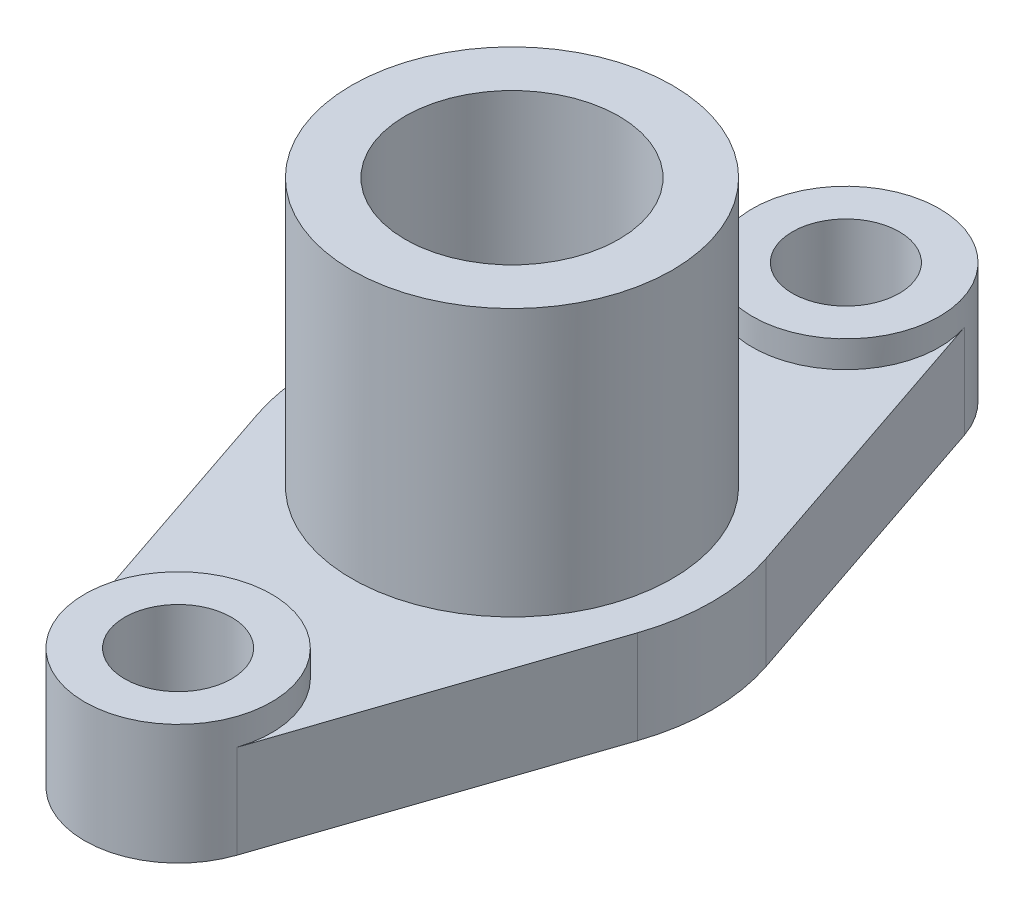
from build123d import *

# Parameters (mm, degrees)
SKETCH_1_R      = 12
SKETCH_1_R_2    = 8
EXTRUDE_1_DEPTH = 27
SKETCH_2_R      = 4
SKETCH_2_R_2    = 8
EXTRUDE_2_DEPTH = 7
SKETCH_3_R      = 7
SKETCH_3_R_2    = 4
EXTRUDE_3_DEPTH = 2


with BuildPart() as part:
    # Sketch 1 → Extrude 1 (new body)
    with BuildSketch(Plane(origin=(0, 0, 0), x_dir=(1, 0, 0), z_dir=(0, 1, 0))):
        with Locations(Location((0, 0, 0), (0, 0, 270))):
            Circle(SKETCH_1_R)
        with Locations(Location((0, 0, 0), (0, 0, 270))):
            Circle(SKETCH_1_R_2, mode=Mode.SUBTRACT)
    extrude(amount=EXTRUDE_1_DEPTH)

    # Sketch 2 → Extrude 2 (add)
    with BuildSketch(Plane.XZ):
        with BuildLine():
            Line((14.21127279, -4.800011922), (6.631921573, -27.240003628))
            ThreePointArc((6.631921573, -27.240003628), (0, -32), (-6.631921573, -27.240003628))
            Line((-6.631921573, -27.240003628), (-14.21127279, -4.800011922))
            ThreePointArc((-14.21127279, -4.800011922), (-15.000012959, 0), (-14.21127279, 4.800011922))
            Line((-14.21127279, 4.800011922), (-6.631921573, 27.240003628))
            ThreePointArc((-6.631921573, 27.240003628), (0, 32), (6.631921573, 27.240003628))
            Line((6.631921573, 27.240003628), (14.21127279, 4.800011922))
            ThreePointArc((14.21127279, 4.800011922), (15.000012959, 0), (14.21127279, -4.800011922))
        make_face()
        with Locations(Location((0, -25, 0), (0, 0, 270))):
            Circle(SKETCH_2_R, mode=Mode.SUBTRACT)
        with Locations(Location((0, 25, 0), (0, 0, 270))):
            Circle(SKETCH_2_R, mode=Mode.SUBTRACT)
        with Locations(Location((0, 0, 0), (0, 0, 90))):
            Circle(SKETCH_2_R_2, mode=Mode.SUBTRACT)
    extrude(amount=-EXTRUDE_2_DEPTH)

    # Sketch 3 → Extrude 3 (add)
    # profile 1 of 2: a face of its own
    with BuildSketch(Plane(origin=(0, 7, 0), x_dir=(-1, 0, 0), z_dir=(0, 1, 0))):
        with Locations(Location((0, 25, 0), (0, 0, 161.337043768))):
            Circle(SKETCH_3_R)
        with Locations(Location((0, 25, 0), (0, 0, 270))):
            Circle(SKETCH_3_R_2, mode=Mode.SUBTRACT)
    # profile 2 of 2: a face of its own
    with BuildSketch(Plane(origin=(0, 7, 0), x_dir=(-1, 0, 0), z_dir=(0, 1, 0))):
        with Locations(Location((0, -25, 0), (0, 0, 341.337043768))):
            Circle(SKETCH_3_R)
        with Locations(Location((0, -25, 0), (0, 0, 270))):
            Circle(SKETCH_3_R_2, mode=Mode.SUBTRACT)
    extrude(amount=EXTRUDE_3_DEPTH)


solid = part.part
